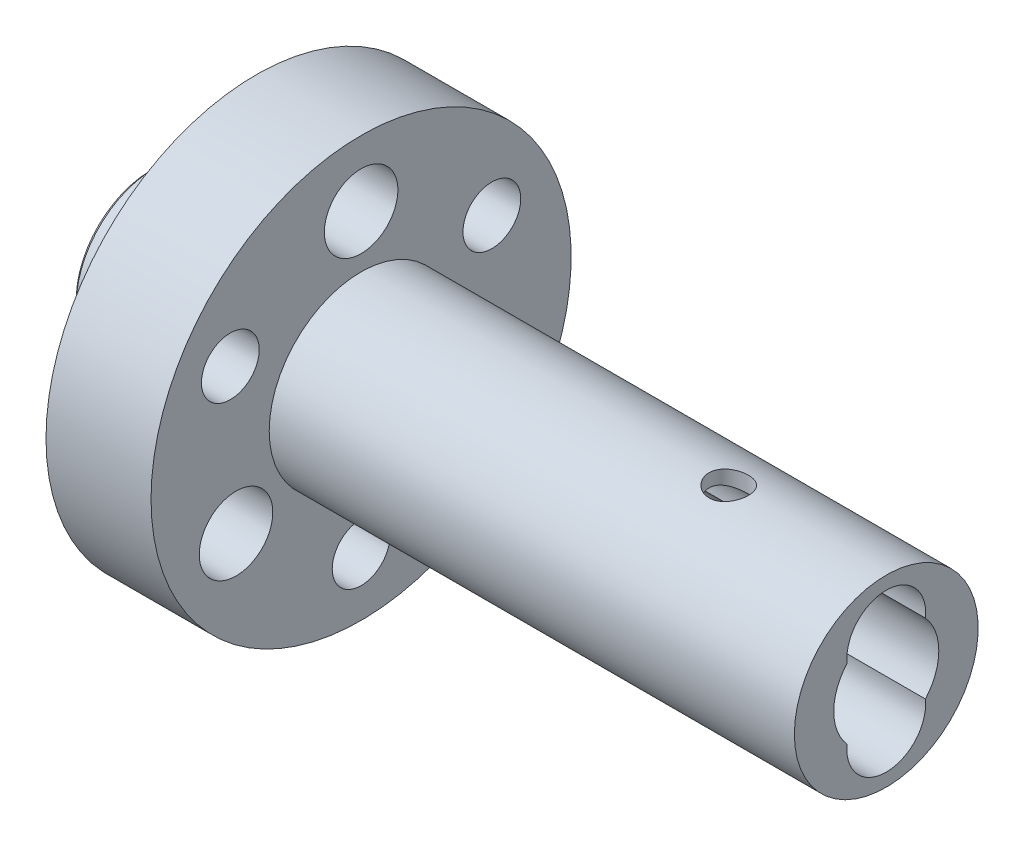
ISO-10303-21;
HEADER;
FILE_DESCRIPTION(('STEP AP214'),'2;1');
FILE_NAME('part.step','',(''),(''),'','','');
FILE_SCHEMA(('AUTOMOTIVE_DESIGN { 1 0 10303 214 1 1 1 1 }'));
ENDSEC;
DATA;
#1=APPLICATION_CONTEXT('core data for automotive mechanical design processes');
#2=APPLICATION_PROTOCOL_DEFINITION('international standard','automotive_design',2000,#1);
#3=PRODUCT_CONTEXT('',#1,'mechanical');
#4=PRODUCT('Part','Part','',(#3));
#5=PRODUCT_RELATED_PRODUCT_CATEGORY('part','',(#4));
#6=PRODUCT_DEFINITION_FORMATION('','',#4);
#7=PRODUCT_DEFINITION_CONTEXT('part definition',#1,'design');
#8=PRODUCT_DEFINITION('design','',#6,#7);
#9=PRODUCT_DEFINITION_SHAPE('','',#8);
#10=(LENGTH_UNIT() NAMED_UNIT(*) SI_UNIT(.MILLI.,.METRE.));
#11=(NAMED_UNIT(*) PLANE_ANGLE_UNIT() SI_UNIT($,.RADIAN.));
#12=(NAMED_UNIT(*) SI_UNIT($,.STERADIAN.) SOLID_ANGLE_UNIT());
#13=UNCERTAINTY_MEASURE_WITH_UNIT(LENGTH_MEASURE(1.E-05),#10,'distance_accuracy_value','');
#14=(GEOMETRIC_REPRESENTATION_CONTEXT(3) GLOBAL_UNCERTAINTY_ASSIGNED_CONTEXT((#13)) GLOBAL_UNIT_ASSIGNED_CONTEXT((#10,
#11,#12)) REPRESENTATION_CONTEXT('',''));
#15=CARTESIAN_POINT('',(0.,0.,0.));
#16=DIRECTION('',(0.,0.,1.));
#17=DIRECTION('',(1.,0.,0.));
#18=AXIS2_PLACEMENT_3D('',#15,#16,#17);
#19=CARTESIAN_POINT('',(3.19999999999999,2.85,0.));
#20=DIRECTION('',(-1.,0.,0.));
#21=DIRECTION('',(0.,0.,1.));
#22=AXIS2_PLACEMENT_3D('',#19,#20,#21);
#23=PLANE('',#22);
#24=CARTESIAN_POINT('',(3.19999999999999,0.,0.));
#25=DIRECTION('',(-1.,0.,0.));
#26=DIRECTION('',(0.,0.,1.));
#27=AXIS2_PLACEMENT_3D('',#24,#25,#26);
#28=CIRCLE('',#27,2.85);
#29=CARTESIAN_POINT('',(3.19999999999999,0.,2.85));
#30=VERTEX_POINT('',#29);
#31=EDGE_CURVE('E138',#30,#30,#28,.T.);
#32=ORIENTED_EDGE('',*,*,#31,.T.);
#33=EDGE_LOOP('',(#32));
#34=FACE_BOUND('',#33,.T.);
#35=CARTESIAN_POINT('',(3.19999999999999,0.,0.));
#36=DIRECTION('',(-1.,0.,0.));
#37=DIRECTION('',(0.,0.,1.));
#38=AXIS2_PLACEMENT_3D('',#35,#36,#37);
#39=CIRCLE('',#38,3.);
#40=CARTESIAN_POINT('',(3.19999999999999,0.,3.));
#41=VERTEX_POINT('',#40);
#42=EDGE_CURVE('E493',#41,#41,#39,.T.);
#43=ORIENTED_EDGE('',*,*,#42,.F.);
#44=EDGE_LOOP('',(#43));
#45=FACE_BOUND('',#44,.T.);
#46=ADVANCED_FACE('F33',(#34,#45),#23,.F.);
#47=CARTESIAN_POINT('',(0.,0.,0.));
#48=DIRECTION('',(1.,0.,0.));
#49=DIRECTION('',(0.,0.,-1.));
#50=AXIS2_PLACEMENT_3D('',#47,#48,#49);
#51=CONICAL_SURFACE('',#50,2.84999999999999,0.785398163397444);
#52=CARTESIAN_POINT('',(0.,0.,0.));
#53=DIRECTION('',(1.,0.,0.));
#54=DIRECTION('',(0.,0.,-1.));
#55=AXIS2_PLACEMENT_3D('',#52,#53,#54);
#56=CIRCLE('',#55,2.84999999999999);
#57=CARTESIAN_POINT('',(0.,0.,-2.84999999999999));
#58=VERTEX_POINT('',#57);
#59=EDGE_CURVE('E12',#58,#58,#56,.F.);
#60=ORIENTED_EDGE('',*,*,#59,.F.);
#61=EDGE_LOOP('',(#60));
#62=FACE_BOUND('',#61,.T.);
#63=CARTESIAN_POINT('',(0.150000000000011,0.,0.));
#64=DIRECTION('',(1.,0.,0.));
#65=DIRECTION('',(0.,0.,-1.));
#66=AXIS2_PLACEMENT_3D('',#63,#64,#65);
#67=CIRCLE('',#66,3.);
#68=CARTESIAN_POINT('',(0.150000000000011,0.,-3.));
#69=VERTEX_POINT('',#68);
#70=EDGE_CURVE('E37',#69,#69,#67,.F.);
#71=ORIENTED_EDGE('',*,*,#70,.T.);
#72=EDGE_LOOP('',(#71));
#73=FACE_BOUND('',#72,.T.);
#74=ADVANCED_FACE('F35',(#62,#73),#51,.T.);
#75=CARTESIAN_POINT('',(0.,3.15,0.));
#76=DIRECTION('',(1.,0.,0.));
#77=DIRECTION('',(0.,0.,-1.));
#78=AXIS2_PLACEMENT_3D('',#75,#76,#77);
#79=PLANE('',#78);
#80=CARTESIAN_POINT('',(0.,0.,0.));
#81=DIRECTION('',(-1.,0.,0.));
#82=DIRECTION('',(0.,0.,1.));
#83=AXIS2_PLACEMENT_3D('',#80,#81,#82);
#84=CIRCLE('',#83,2.5);
#85=CARTESIAN_POINT('',(0.,0.,2.5));
#86=VERTEX_POINT('',#85);
#87=EDGE_CURVE('E277',#86,#86,#84,.T.);
#88=ORIENTED_EDGE('',*,*,#87,.F.);
#89=EDGE_LOOP('',(#88));
#90=FACE_BOUND('',#89,.T.);
#91=ORIENTED_EDGE('',*,*,#59,.T.);
#92=EDGE_LOOP('',(#91));
#93=FACE_BOUND('',#92,.T.);
#94=ADVANCED_FACE('F223',(#90,#93),#79,.F.);
#95=CARTESIAN_POINT('',(1.,2.35,0.));
#96=DIRECTION('',(1.,0.,0.));
#97=DIRECTION('',(0.,0.,-1.));
#98=AXIS2_PLACEMENT_3D('',#95,#96,#97);
#99=PLANE('',#98);
#100=CARTESIAN_POINT('',(1.,0.,0.));
#101=DIRECTION('',(-1.,0.,0.));
#102=DIRECTION('',(0.,0.,1.));
#103=AXIS2_PLACEMENT_3D('',#100,#101,#102);
#104=CIRCLE('',#103,2.);
#105=CARTESIAN_POINT('',(1.,0.,2.));
#106=VERTEX_POINT('',#105);
#107=EDGE_CURVE('E158',#106,#106,#104,.T.);
#108=ORIENTED_EDGE('',*,*,#107,.F.);
#109=EDGE_LOOP('',(#108));
#110=FACE_BOUND('',#109,.T.);
#111=CARTESIAN_POINT('',(1.,0.,0.));
#112=DIRECTION('',(-1.,0.,0.));
#113=DIRECTION('',(0.,0.,1.));
#114=AXIS2_PLACEMENT_3D('',#111,#112,#113);
#115=CIRCLE('',#114,2.5);
#116=CARTESIAN_POINT('',(1.,0.,2.5));
#117=VERTEX_POINT('',#116);
#118=EDGE_CURVE('E273',#117,#117,#115,.T.);
#119=ORIENTED_EDGE('',*,*,#118,.T.);
#120=EDGE_LOOP('',(#119));
#121=FACE_BOUND('',#120,.T.);
#122=ADVANCED_FACE('F321',(#110,#121),#99,.F.);
#123=CARTESIAN_POINT('',(0.,0.,0.));
#124=DIRECTION('',(-1.,0.,0.));
#125=DIRECTION('',(0.,0.,1.));
#126=AXIS2_PLACEMENT_3D('',#123,#124,#125);
#127=CYLINDRICAL_SURFACE('',#126,2.);
#128=DIRECTION('',(1.,0.,0.));
#129=VECTOR('',#128,1.);
#130=CARTESIAN_POINT('',(18.,-1.33333333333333,1.49071198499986));
#131=LINE('',#130,#129);
#132=CARTESIAN_POINT('',(18.,-1.33333333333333,1.49071198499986));
#133=VERTEX_POINT('',#132);
#134=CARTESIAN_POINT('',(28.,-1.33333333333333,1.49071198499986));
#135=VERTEX_POINT('',#134);
#136=EDGE_CURVE('E49',#133,#135,#131,.T.);
#137=ORIENTED_EDGE('',*,*,#136,.F.);
#138=CARTESIAN_POINT('',(18.,0.,0.));
#139=DIRECTION('',(1.,0.,0.));
#140=DIRECTION('',(0.,0.,-1.));
#141=AXIS2_PLACEMENT_3D('',#138,#139,#140);
#142=CIRCLE('',#141,2.);
#143=CARTESIAN_POINT('',(18.,-1.33333333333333,-1.49071198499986));
#144=VERTEX_POINT('',#143);
#145=EDGE_CURVE('E42',#144,#133,#142,.F.);
#146=ORIENTED_EDGE('',*,*,#145,.F.);
#147=DIRECTION('',(1.,0.,0.));
#148=VECTOR('',#147,1.);
#149=CARTESIAN_POINT('',(18.,-1.33333333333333,-1.49071198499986));
#150=LINE('',#149,#148);
#151=CARTESIAN_POINT('',(28.,-1.33333333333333,-1.49071198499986));
#152=VERTEX_POINT('',#151);
#153=EDGE_CURVE('E85',#144,#152,#150,.T.);
#154=ORIENTED_EDGE('',*,*,#153,.T.);
#155=CARTESIAN_POINT('',(28.,0.,0.));
#156=DIRECTION('',(-1.,0.,0.));
#157=DIRECTION('',(0.,0.,1.));
#158=AXIS2_PLACEMENT_3D('',#155,#156,#157);
#159=CIRCLE('',#158,2.);
#160=CARTESIAN_POINT('',(28.,1.33333333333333,-1.49071198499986));
#161=VERTEX_POINT('',#160);
#162=EDGE_CURVE('E157',#161,#152,#159,.T.);
#163=ORIENTED_EDGE('',*,*,#162,.F.);
#164=DIRECTION('',(1.,0.,0.));
#165=VECTOR('',#164,1.);
#166=CARTESIAN_POINT('',(18.,1.33333333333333,-1.49071198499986));
#167=LINE('',#166,#165);
#168=CARTESIAN_POINT('',(18.,1.33333333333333,-1.49071198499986));
#169=VERTEX_POINT('',#168);
#170=EDGE_CURVE('E57',#169,#161,#167,.T.);
#171=ORIENTED_EDGE('',*,*,#170,.F.);
#172=CARTESIAN_POINT('',(18.,1.33333333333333,1.49071198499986));
#173=VERTEX_POINT('',#172);
#174=EDGE_CURVE('E81',#173,#169,#142,.F.);
#175=ORIENTED_EDGE('',*,*,#174,.F.);
#176=DIRECTION('',(1.,0.,0.));
#177=VECTOR('',#176,1.);
#178=CARTESIAN_POINT('',(18.,1.33333333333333,1.49071198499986));
#179=LINE('',#178,#177);
#180=CARTESIAN_POINT('',(28.,1.33333333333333,1.49071198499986));
#181=VERTEX_POINT('',#180);
#182=EDGE_CURVE('E195',#173,#181,#179,.T.);
#183=ORIENTED_EDGE('',*,*,#182,.T.);
#184=EDGE_CURVE('E94',#135,#181,#159,.T.);
#185=ORIENTED_EDGE('',*,*,#184,.F.);
#186=EDGE_LOOP('',(#137,#146,#154,#163,#171,#175,#183,#185));
#187=FACE_BOUND('',#186,.T.);
#188=ORIENTED_EDGE('',*,*,#107,.T.);
#189=EDGE_LOOP('',(#188));
#190=FACE_BOUND('',#189,.T.);
#191=ADVANCED_FACE('F90',(#187,#190),#127,.F.);
#192=CARTESIAN_POINT('',(28.,2.,0.));
#193=DIRECTION('',(-1.,0.,0.));
#194=DIRECTION('',(0.,0.,1.));
#195=AXIS2_PLACEMENT_3D('',#192,#193,#194);
#196=PLANE('',#195);
#197=CARTESIAN_POINT('',(28.,0.,0.));
#198=DIRECTION('',(-1.,0.,0.));
#199=DIRECTION('',(0.,0.,1.));
#200=AXIS2_PLACEMENT_3D('',#197,#198,#199);
#201=CIRCLE('',#200,3.5);
#202=CARTESIAN_POINT('',(28.,0.,3.5));
#203=VERTEX_POINT('',#202);
#204=EDGE_CURVE('E153',#203,#203,#201,.T.);
#205=ORIENTED_EDGE('',*,*,#204,.F.);
#206=EDGE_LOOP('',(#205));
#207=FACE_BOUND('',#206,.T.);
#208=ORIENTED_EDGE('',*,*,#184,.T.);
#209=CARTESIAN_POINT('',(28.,1.5,0.));
#210=DIRECTION('',(1.,0.,0.));
#211=DIRECTION('',(0.,0.,-1.));
#212=AXIS2_PLACEMENT_3D('',#209,#210,#211);
#213=CIRCLE('',#212,1.5);
#214=EDGE_CURVE('E87',#161,#181,#213,.T.);
#215=ORIENTED_EDGE('',*,*,#214,.F.);
#216=ORIENTED_EDGE('',*,*,#162,.T.);
#217=CARTESIAN_POINT('',(28.,-1.5,0.));
#218=DIRECTION('',(1.,0.,0.));
#219=DIRECTION('',(0.,0.,1.));
#220=AXIS2_PLACEMENT_3D('',#217,#218,#219);
#221=CIRCLE('',#220,1.5);
#222=EDGE_CURVE('E272',#135,#152,#221,.T.);
#223=ORIENTED_EDGE('',*,*,#222,.F.);
#224=EDGE_LOOP('',(#208,#215,#216,#223));
#225=FACE_BOUND('',#224,.T.);
#226=ADVANCED_FACE('F247',(#207,#225),#196,.F.);
#227=CARTESIAN_POINT('',(0.,0.,0.));
#228=DIRECTION('',(-1.,0.,0.));
#229=DIRECTION('',(0.,0.,1.));
#230=AXIS2_PLACEMENT_3D('',#227,#228,#229);
#231=CYLINDRICAL_SURFACE('',#230,3.5);
#232=CARTESIAN_POINT('',(22.,-3.41869858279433,0.750000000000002));
#233=CARTESIAN_POINT('',(22.0416055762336,-3.41869942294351,0.749998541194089));
#234=CARTESIAN_POINT('',(22.0832288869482,-3.41946636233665,0.746526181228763));
#235=CARTESIAN_POINT('',(22.1652933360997,-3.42244589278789,0.732742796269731));
#236=CARTESIAN_POINT('',(22.2057335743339,-3.42465955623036,0.72242669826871));
#237=CARTESIAN_POINT('',(22.2842328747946,-3.4302705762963,0.695294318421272));
#238=CARTESIAN_POINT('',(22.3222944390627,-3.43366666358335,0.678485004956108));
#239=CARTESIAN_POINT('',(22.3950576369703,-3.44125835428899,0.638863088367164));
#240=CARTESIAN_POINT('',(22.429759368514,-3.44545393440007,0.616050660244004));
#241=CARTESIAN_POINT('',(22.4953814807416,-3.45424789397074,0.564675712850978));
#242=CARTESIAN_POINT('',(22.5262394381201,-3.45885124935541,0.536034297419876));
#243=CARTESIAN_POINT('',(22.5827517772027,-3.46789845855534,0.473984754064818));
#244=CARTESIAN_POINT('',(22.60840576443,-3.47234230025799,0.440576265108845));
#245=CARTESIAN_POINT('',(22.6540277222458,-3.48062384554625,0.369523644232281));
#246=CARTESIAN_POINT('',(22.6739358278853,-3.4844549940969,0.331840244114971));
#247=CARTESIAN_POINT('',(22.7071138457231,-3.49102335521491,0.253567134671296));
#248=CARTESIAN_POINT('',(22.7203844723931,-3.49376068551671,0.212977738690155));
#249=CARTESIAN_POINT('',(22.7397149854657,-3.49779782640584,0.130693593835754));
#250=CARTESIAN_POINT('',(22.7458804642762,-3.49911866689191,0.0890247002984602));
#251=CARTESIAN_POINT('',(22.7511556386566,-3.50024681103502,0.00522447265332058));
#252=CARTESIAN_POINT('',(22.7502661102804,-3.5000542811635,-0.0369068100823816));
#253=CARTESIAN_POINT('',(22.7415355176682,-3.49819350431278,-0.119708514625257));
#254=CARTESIAN_POINT('',(22.733808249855,-3.49654941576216,-0.160391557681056));
#255=CARTESIAN_POINT('',(22.7118026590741,-3.49199770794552,-0.239869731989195));
#256=CARTESIAN_POINT('',(22.6975240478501,-3.48909003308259,-0.27866478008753));
#257=CARTESIAN_POINT('',(22.6627192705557,-3.48229877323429,-0.353583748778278));
#258=CARTESIAN_POINT('',(22.6421496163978,-3.47840842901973,-0.389686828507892));
#259=CARTESIAN_POINT('',(22.5953790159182,-3.47007896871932,-0.457970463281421));
#260=CARTESIAN_POINT('',(22.5691773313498,-3.46563978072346,-0.490150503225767));
#261=CARTESIAN_POINT('',(22.5112657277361,-3.45659663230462,-0.550351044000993));
#262=CARTESIAN_POINT('',(22.4794562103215,-3.45199115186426,-0.578275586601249));
#263=CARTESIAN_POINT('',(22.4115583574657,-3.44321783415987,-0.628411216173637));
#264=CARTESIAN_POINT('',(22.3754699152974,-3.43905000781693,-0.650622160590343));
#265=CARTESIAN_POINT('',(22.2998877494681,-3.43162011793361,-0.688740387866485));
#266=CARTESIAN_POINT('',(22.2603849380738,-3.42836057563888,-0.704630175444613));
#267=CARTESIAN_POINT('',(22.1791836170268,-3.42315170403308,-0.729517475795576));
#268=CARTESIAN_POINT('',(22.1374854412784,-3.42120217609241,-0.73851603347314));
#269=CARTESIAN_POINT('',(22.0539521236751,-3.41887440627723,-0.749217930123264));
#270=CARTESIAN_POINT('',(22.0121356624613,-3.4184661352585,-0.751060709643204));
#271=CARTESIAN_POINT('',(21.9287930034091,-3.41918619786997,-0.747775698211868));
#272=CARTESIAN_POINT('',(21.8872667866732,-3.42031443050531,-0.742648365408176));
#273=CARTESIAN_POINT('',(21.8061647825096,-3.42395207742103,-0.725689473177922));
#274=CARTESIAN_POINT('',(21.7665722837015,-3.42644577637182,-0.713934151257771));
#275=CARTESIAN_POINT('',(21.6899188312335,-3.43251929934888,-0.684135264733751));
#276=CARTESIAN_POINT('',(21.6528581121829,-3.43609922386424,-0.666091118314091));
#277=CARTESIAN_POINT('',(21.5817151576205,-3.44400817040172,-0.623917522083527));
#278=CARTESIAN_POINT('',(21.5476852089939,-3.44834750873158,-0.599701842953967));
#279=CARTESIAN_POINT('',(21.4841208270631,-3.45725887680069,-0.545985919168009));
#280=CARTESIAN_POINT('',(21.4545869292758,-3.46183093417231,-0.516485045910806));
#281=CARTESIAN_POINT('',(21.4003148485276,-3.47079119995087,-0.452406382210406));
#282=CARTESIAN_POINT('',(21.3756715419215,-3.47517467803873,-0.417747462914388));
#283=CARTESIAN_POINT('',(21.3325572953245,-3.4831780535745,-0.344700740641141));
#284=CARTESIAN_POINT('',(21.3140860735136,-3.48679798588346,-0.306313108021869));
#285=CARTESIAN_POINT('',(21.2839739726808,-3.49284639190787,-0.227132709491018));
#286=CARTESIAN_POINT('',(21.2722908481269,-3.49528221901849,-0.186356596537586));
#287=CARTESIAN_POINT('',(21.2559541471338,-3.4987196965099,-0.103362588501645));
#288=CARTESIAN_POINT('',(21.251299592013,-3.49972154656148,-0.0611448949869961));
#289=CARTESIAN_POINT('',(21.2491946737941,-3.50017255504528,0.0226318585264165));
#290=CARTESIAN_POINT('',(21.2516024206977,-3.49965229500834,0.0641872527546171));
#291=CARTESIAN_POINT('',(21.2632373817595,-3.49718276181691,0.146286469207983));
#292=CARTESIAN_POINT('',(21.2724644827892,-3.49523351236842,0.186830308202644));
#293=CARTESIAN_POINT('',(21.2974094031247,-3.49012694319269,0.265650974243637));
#294=CARTESIAN_POINT('',(21.3131078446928,-3.48697323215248,0.303934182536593));
#295=CARTESIAN_POINT('',(21.3505306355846,-3.47979518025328,0.377342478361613));
#296=CARTESIAN_POINT('',(21.372255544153,-3.47577075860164,0.412467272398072));
#297=CARTESIAN_POINT('',(21.4215811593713,-3.46719904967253,0.479256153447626));
#298=CARTESIAN_POINT('',(21.4492820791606,-3.4626435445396,0.510845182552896));
#299=CARTESIAN_POINT('',(21.5095703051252,-3.45356845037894,0.568975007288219));
#300=CARTESIAN_POINT('',(21.5421587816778,-3.44904887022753,0.595514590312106));
#301=CARTESIAN_POINT('',(21.6117952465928,-3.44049346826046,0.643116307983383));
#302=CARTESIAN_POINT('',(21.6488946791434,-3.43646452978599,0.664104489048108));
#303=CARTESIAN_POINT('',(21.7261718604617,-3.42943248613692,0.699515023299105));
#304=CARTESIAN_POINT('',(21.7663469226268,-3.42642849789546,0.71394303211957));
#305=CARTESIAN_POINT('',(21.8388130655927,-3.42235280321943,0.733193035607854));
#306=CARTESIAN_POINT('',(21.8707058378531,-3.42099141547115,0.739483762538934));
#307=CARTESIAN_POINT('',(21.9350621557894,-3.41916399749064,0.747887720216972));
#308=CARTESIAN_POINT('',(21.967525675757,-3.41869792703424,0.75000113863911));
#309=CARTESIAN_POINT('',(22.,-3.41869858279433,0.750000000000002));
#310=B_SPLINE_CURVE_WITH_KNOTS('',3,(#232,#233,#234,#235,#236,#237,#238,#239,#240,#241,#242,
#243,#244,#245,#246,#247,#248,#249,#250,#251,#252,#253,#254,#255,#256,#257,#258,#259,#260,#261,
#262,#263,#264,#265,#266,#267,#268,#269,#270,#271,#272,#273,#274,#275,#276,#277,#278,#279,#280,
#281,#282,#283,#284,#285,#286,#287,#288,#289,#290,#291,#292,#293,#294,#295,#296,#297,#298,#299,
#300,#301,#302,#303,#304,#305,#306,#307,#308,#309),.UNSPECIFIED.,.T.,.F.,(4,2,2,2,2,2,2,2,2,2,2,
2,2,2,2,2,2,2,2,2,2,2,2,2,2,2,2,2,2,2,2,2,2,2,2,2,2,2,4),(0.,0.124697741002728,
0.249488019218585,0.374144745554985,0.498797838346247,0.625266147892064,0.751744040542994,
0.879495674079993,1.00723355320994,1.13304754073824,1.25884768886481,1.38259278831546,
1.50634333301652,1.63096944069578,1.75561189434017,1.88274480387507,2.00988088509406,
2.1373664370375,2.26483265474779,2.38980216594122,2.51476346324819,2.63831590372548,
2.76187977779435,2.88727505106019,3.01268524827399,3.14033107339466,3.26797106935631,
3.39480794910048,3.5216271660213,3.64591599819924,3.77020276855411,3.89412004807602,
4.01804883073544,4.14424457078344,4.27047057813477,4.39830190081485,4.52602280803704,
4.62335728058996,4.72068738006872),.UNSPECIFIED.);
#311=CARTESIAN_POINT('',(22.,-3.41869858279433,0.750000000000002));
#312=VERTEX_POINT('',#311);
#313=EDGE_CURVE('E105',#312,#312,#310,.T.);
#314=ORIENTED_EDGE('',*,*,#313,.T.);
#315=EDGE_LOOP('',(#314));
#316=FACE_BOUND('',#315,.T.);
#317=CARTESIAN_POINT('',(22.,3.41869858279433,0.750000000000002));
#318=CARTESIAN_POINT('',(21.9583944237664,3.41869942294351,0.74999854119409));
#319=CARTESIAN_POINT('',(21.9167711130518,3.41946636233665,0.746526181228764));
#320=CARTESIAN_POINT('',(21.8347066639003,3.42244589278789,0.732742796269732));
#321=CARTESIAN_POINT('',(21.7942664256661,3.42465955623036,0.722426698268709));
#322=CARTESIAN_POINT('',(21.7157671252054,3.4302705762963,0.695294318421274));
#323=CARTESIAN_POINT('',(21.6777055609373,3.43366666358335,0.678485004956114));
#324=CARTESIAN_POINT('',(21.6049423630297,3.44125835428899,0.638863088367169));
#325=CARTESIAN_POINT('',(21.570240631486,3.44545393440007,0.616050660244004));
#326=CARTESIAN_POINT('',(21.5046185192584,3.45424789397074,0.564675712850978));
#327=CARTESIAN_POINT('',(21.4737605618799,3.45885124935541,0.536034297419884));
#328=CARTESIAN_POINT('',(21.4172482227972,3.46789845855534,0.473984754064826));
#329=CARTESIAN_POINT('',(21.39159423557,3.47234230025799,0.440576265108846));
#330=CARTESIAN_POINT('',(21.3459722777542,3.48062384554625,0.36952364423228));
#331=CARTESIAN_POINT('',(21.3260641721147,3.4844549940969,0.331840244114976));
#332=CARTESIAN_POINT('',(21.2928861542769,3.49102335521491,0.253567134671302));
#333=CARTESIAN_POINT('',(21.2796155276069,3.49376068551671,0.212977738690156));
#334=CARTESIAN_POINT('',(21.2602850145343,3.49779782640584,0.130693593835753));
#335=CARTESIAN_POINT('',(21.2541195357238,3.49911866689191,0.0890247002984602));
#336=CARTESIAN_POINT('',(21.2488443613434,3.50024681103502,0.0052244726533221));
#337=CARTESIAN_POINT('',(21.2497338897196,3.5000542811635,-0.0369068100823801));
#338=CARTESIAN_POINT('',(21.2584644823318,3.49819350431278,-0.119708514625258));
#339=CARTESIAN_POINT('',(21.266191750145,3.49654941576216,-0.160391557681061));
#340=CARTESIAN_POINT('',(21.2881973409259,3.49199770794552,-0.239869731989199));
#341=CARTESIAN_POINT('',(21.3024759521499,3.48909003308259,-0.278664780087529));
#342=CARTESIAN_POINT('',(21.3372807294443,3.48229877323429,-0.353583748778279));
#343=CARTESIAN_POINT('',(21.3578503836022,3.47840842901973,-0.389686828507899));
#344=CARTESIAN_POINT('',(21.4046209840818,3.47007896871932,-0.457970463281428));
#345=CARTESIAN_POINT('',(21.4308226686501,3.46563978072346,-0.490150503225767));
#346=CARTESIAN_POINT('',(21.4887342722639,3.45659663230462,-0.550351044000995));
#347=CARTESIAN_POINT('',(21.5205437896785,3.45199115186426,-0.578275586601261));
#348=CARTESIAN_POINT('',(21.5884416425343,3.44321783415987,-0.628411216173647));
#349=CARTESIAN_POINT('',(21.6245300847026,3.43905000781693,-0.650622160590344));
#350=CARTESIAN_POINT('',(21.7001122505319,3.43162011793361,-0.688740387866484));
#351=CARTESIAN_POINT('',(21.7396150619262,3.42836057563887,-0.70463017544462));
#352=CARTESIAN_POINT('',(21.8208163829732,3.42315170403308,-0.729517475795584));
#353=CARTESIAN_POINT('',(21.8625145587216,3.42120217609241,-0.738516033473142));
#354=CARTESIAN_POINT('',(21.9460478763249,3.41887440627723,-0.749217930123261));
#355=CARTESIAN_POINT('',(21.9878643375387,3.4184661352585,-0.751060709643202));
#356=CARTESIAN_POINT('',(22.0712069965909,3.41918619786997,-0.747775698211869));
#357=CARTESIAN_POINT('',(22.1127332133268,3.42031443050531,-0.742648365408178));
#358=CARTESIAN_POINT('',(22.1938352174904,3.42395207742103,-0.725689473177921));
#359=CARTESIAN_POINT('',(22.2334277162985,3.42644577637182,-0.713934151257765));
#360=CARTESIAN_POINT('',(22.3100811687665,3.43251929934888,-0.684135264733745));
#361=CARTESIAN_POINT('',(22.3471418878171,3.43609922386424,-0.666091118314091));
#362=CARTESIAN_POINT('',(22.4182848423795,3.44400817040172,-0.623917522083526));
#363=CARTESIAN_POINT('',(22.4523147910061,3.44834750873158,-0.59970184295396));
#364=CARTESIAN_POINT('',(22.5158791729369,3.45725887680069,-0.545985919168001));
#365=CARTESIAN_POINT('',(22.5454130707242,3.46183093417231,-0.516485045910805));
#366=CARTESIAN_POINT('',(22.5996851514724,3.47079119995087,-0.452406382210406));
#367=CARTESIAN_POINT('',(22.6243284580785,3.47517467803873,-0.417747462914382));
#368=CARTESIAN_POINT('',(22.6674427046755,3.4831780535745,-0.344700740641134));
#369=CARTESIAN_POINT('',(22.6859139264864,3.48679798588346,-0.306313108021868));
#370=CARTESIAN_POINT('',(22.7160260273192,3.49284639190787,-0.227132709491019));
#371=CARTESIAN_POINT('',(22.7277091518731,3.49528221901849,-0.186356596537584));
#372=CARTESIAN_POINT('',(22.7440458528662,3.4987196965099,-0.103362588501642));
#373=CARTESIAN_POINT('',(22.748700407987,3.49972154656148,-0.0611448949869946));
#374=CARTESIAN_POINT('',(22.7508053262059,3.50017255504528,0.0226318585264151));
#375=CARTESIAN_POINT('',(22.7483975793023,3.49965229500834,0.0641872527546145));
#376=CARTESIAN_POINT('',(22.7367626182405,3.49718276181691,0.146286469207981));
#377=CARTESIAN_POINT('',(22.7275355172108,3.49523351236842,0.186830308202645));
#378=CARTESIAN_POINT('',(22.7025905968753,3.49012694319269,0.265650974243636));
#379=CARTESIAN_POINT('',(22.6868921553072,3.48697323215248,0.303934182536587));
#380=CARTESIAN_POINT('',(22.6494693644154,3.47979518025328,0.377342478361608));
#381=CARTESIAN_POINT('',(22.627744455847,3.47577075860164,0.412467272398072));
#382=CARTESIAN_POINT('',(22.5784188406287,3.46719904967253,0.479256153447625));
#383=CARTESIAN_POINT('',(22.5507179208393,3.4626435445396,0.510845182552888));
#384=CARTESIAN_POINT('',(22.4904296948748,3.45356845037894,0.56897500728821));
#385=CARTESIAN_POINT('',(22.4578412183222,3.44904887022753,0.595514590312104));
#386=CARTESIAN_POINT('',(22.3882047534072,3.44049346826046,0.643116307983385));
#387=CARTESIAN_POINT('',(22.3511053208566,3.43646452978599,0.664104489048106));
#388=CARTESIAN_POINT('',(22.2738281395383,3.42943248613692,0.699515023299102));
#389=CARTESIAN_POINT('',(22.2336530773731,3.42642849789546,0.713943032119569));
#390=CARTESIAN_POINT('',(22.1611869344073,3.42235280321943,0.733193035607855));
#391=CARTESIAN_POINT('',(22.1292941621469,3.42099141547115,0.739483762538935));
#392=CARTESIAN_POINT('',(22.0649378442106,3.41916399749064,0.747887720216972));
#393=CARTESIAN_POINT('',(22.032474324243,3.41869792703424,0.75000113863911));
#394=CARTESIAN_POINT('',(22.,3.41869858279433,0.750000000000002));
#395=B_SPLINE_CURVE_WITH_KNOTS('',3,(#317,#318,#319,#320,#321,#322,#323,#324,#325,#326,#327,
#328,#329,#330,#331,#332,#333,#334,#335,#336,#337,#338,#339,#340,#341,#342,#343,#344,#345,#346,
#347,#348,#349,#350,#351,#352,#353,#354,#355,#356,#357,#358,#359,#360,#361,#362,#363,#364,#365,
#366,#367,#368,#369,#370,#371,#372,#373,#374,#375,#376,#377,#378,#379,#380,#381,#382,#383,#384,
#385,#386,#387,#388,#389,#390,#391,#392,#393,#394),.UNSPECIFIED.,.T.,.F.,(4,2,2,2,2,2,2,2,2,2,2,
2,2,2,2,2,2,2,2,2,2,2,2,2,2,2,2,2,2,2,2,2,2,2,2,2,2,2,4),(0.,0.124697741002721,
0.249488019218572,0.374144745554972,0.498797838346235,0.625266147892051,0.751744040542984,
0.879495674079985,1.00723355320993,1.13304754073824,1.2588476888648,1.38259278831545,
1.50634333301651,1.63096944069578,1.75561189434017,1.88274480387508,2.00988088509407,
2.13736643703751,2.2648326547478,2.38980216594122,2.51476346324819,2.63831590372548,
2.76187977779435,2.88727505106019,3.01268524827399,3.14033107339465,3.26797106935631,
3.39480794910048,3.52162716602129,3.64591599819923,3.7702027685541,3.89412004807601,
4.01804883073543,4.14424457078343,4.27047057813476,4.39830190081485,4.52602280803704,
4.62335728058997,4.72068738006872),.UNSPECIFIED.);
#396=CARTESIAN_POINT('',(22.,3.41869858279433,0.750000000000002));
#397=VERTEX_POINT('',#396);
#398=EDGE_CURVE('E161',#397,#397,#395,.T.);
#399=ORIENTED_EDGE('',*,*,#398,.T.);
#400=EDGE_LOOP('',(#399));
#401=FACE_BOUND('',#400,.T.);
#402=CARTESIAN_POINT('',(8.00000000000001,0.,0.));
#403=DIRECTION('',(-1.,0.,0.));
#404=DIRECTION('',(0.,0.,1.));
#405=AXIS2_PLACEMENT_3D('',#402,#403,#404);
#406=CIRCLE('',#405,3.5);
#407=CARTESIAN_POINT('',(8.00000000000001,0.,3.5));
#408=VERTEX_POINT('',#407);
#409=EDGE_CURVE('E150',#408,#408,#406,.T.);
#410=ORIENTED_EDGE('',*,*,#409,.F.);
#411=EDGE_LOOP('',(#410));
#412=FACE_BOUND('',#411,.T.);
#413=ORIENTED_EDGE('',*,*,#204,.T.);
#414=EDGE_LOOP('',(#413));
#415=FACE_BOUND('',#414,.T.);
#416=ADVANCED_FACE('F172',(#316,#401,#412,#415),#231,.T.);
#417=CARTESIAN_POINT('',(8.00000000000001,3.5,0.));
#418=DIRECTION('',(-1.,0.,0.));
#419=DIRECTION('',(0.,0.,1.));
#420=AXIS2_PLACEMENT_3D('',#417,#418,#419);
#421=PLANE('',#420);
#422=CARTESIAN_POINT('',(8.00000000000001,2.87499999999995,-4.97964607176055));
#423=DIRECTION('',(-1.,0.,0.));
#424=DIRECTION('',(0.,0.,1.));
#425=AXIS2_PLACEMENT_3D('',#422,#423,#424);
#426=CIRCLE('',#425,1.09999999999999);
#427=CARTESIAN_POINT('',(8.00000000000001,2.87499999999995,-3.87964607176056));
#428=VERTEX_POINT('',#427);
#429=EDGE_CURVE('E104',#428,#428,#426,.T.);
#430=ORIENTED_EDGE('',*,*,#429,.T.);
#431=EDGE_LOOP('',(#430));
#432=FACE_BOUND('',#431,.T.);
#433=CARTESIAN_POINT('',(8.00000000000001,2.87500000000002,4.97964607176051));
#434=DIRECTION('',(-1.,0.,0.));
#435=DIRECTION('',(0.,0.,1.));
#436=AXIS2_PLACEMENT_3D('',#433,#434,#435);
#437=CIRCLE('',#436,1.09999999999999);
#438=CARTESIAN_POINT('',(8.00000000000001,2.87500000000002,6.0796460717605));
#439=VERTEX_POINT('',#438);
#440=EDGE_CURVE('E111',#439,#439,#437,.T.);
#441=ORIENTED_EDGE('',*,*,#440,.T.);
#442=EDGE_LOOP('',(#441));
#443=FACE_BOUND('',#442,.T.);
#444=CARTESIAN_POINT('',(8.00000000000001,-2.74999999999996,4.76313972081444));
#445=DIRECTION('',(-1.,0.,0.));
#446=DIRECTION('',(0.,0.,1.));
#447=AXIS2_PLACEMENT_3D('',#444,#445,#446);
#448=CIRCLE('',#447,1.39999999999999);
#449=CARTESIAN_POINT('',(8.00000000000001,-2.74999999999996,6.16313972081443));
#450=VERTEX_POINT('',#449);
#451=EDGE_CURVE('E117',#450,#450,#448,.T.);
#452=ORIENTED_EDGE('',*,*,#451,.T.);
#453=EDGE_LOOP('',(#452));
#454=FACE_BOUND('',#453,.T.);
#455=CARTESIAN_POINT('',(8.00000000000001,-2.75000000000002,-4.7631397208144));
#456=DIRECTION('',(-1.,0.,0.));
#457=DIRECTION('',(0.,0.,1.));
#458=AXIS2_PLACEMENT_3D('',#455,#456,#457);
#459=CIRCLE('',#458,1.39999999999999);
#460=CARTESIAN_POINT('',(8.00000000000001,-2.75000000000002,-3.36313972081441));
#461=VERTEX_POINT('',#460);
#462=EDGE_CURVE('E123',#461,#461,#459,.T.);
#463=ORIENTED_EDGE('',*,*,#462,.T.);
#464=EDGE_LOOP('',(#463));
#465=FACE_BOUND('',#464,.T.);
#466=CARTESIAN_POINT('',(8.00000000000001,-5.75,0.));
#467=DIRECTION('',(-1.,0.,0.));
#468=DIRECTION('',(0.,0.,1.));
#469=AXIS2_PLACEMENT_3D('',#466,#467,#468);
#470=CIRCLE('',#469,1.09999999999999);
#471=CARTESIAN_POINT('',(8.00000000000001,-5.75,1.09999999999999));
#472=VERTEX_POINT('',#471);
#473=EDGE_CURVE('E129',#472,#472,#470,.T.);
#474=ORIENTED_EDGE('',*,*,#473,.T.);
#475=EDGE_LOOP('',(#474));
#476=FACE_BOUND('',#475,.T.);
#477=CARTESIAN_POINT('',(8.00000000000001,5.5,0.));
#478=DIRECTION('',(-1.,0.,0.));
#479=DIRECTION('',(0.,0.,1.));
#480=AXIS2_PLACEMENT_3D('',#477,#478,#479);
#481=CIRCLE('',#480,1.39999999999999);
#482=CARTESIAN_POINT('',(8.00000000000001,5.5,1.39999999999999));
#483=VERTEX_POINT('',#482);
#484=EDGE_CURVE('E135',#483,#483,#481,.T.);
#485=ORIENTED_EDGE('',*,*,#484,.T.);
#486=EDGE_LOOP('',(#485));
#487=FACE_BOUND('',#486,.T.);
#488=CARTESIAN_POINT('',(8.00000000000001,0.,0.));
#489=DIRECTION('',(-1.,0.,0.));
#490=DIRECTION('',(0.,0.,1.));
#491=AXIS2_PLACEMENT_3D('',#488,#489,#490);
#492=CIRCLE('',#491,8.);
#493=CARTESIAN_POINT('',(8.00000000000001,0.,8.));
#494=VERTEX_POINT('',#493);
#495=EDGE_CURVE('E147',#494,#494,#492,.T.);
#496=ORIENTED_EDGE('',*,*,#495,.F.);
#497=EDGE_LOOP('',(#496));
#498=FACE_BOUND('',#497,.T.);
#499=ORIENTED_EDGE('',*,*,#409,.T.);
#500=EDGE_LOOP('',(#499));
#501=FACE_BOUND('',#500,.T.);
#502=ADVANCED_FACE('F240',(#432,#443,#454,#465,#476,#487,#498,#501),#421,.F.);
#503=CARTESIAN_POINT('',(0.,0.,0.));
#504=DIRECTION('',(-1.,0.,0.));
#505=DIRECTION('',(0.,0.,1.));
#506=AXIS2_PLACEMENT_3D('',#503,#504,#505);
#507=CYLINDRICAL_SURFACE('',#506,8.);
#508=CARTESIAN_POINT('',(4.,0.,0.));
#509=DIRECTION('',(-1.,0.,0.));
#510=DIRECTION('',(0.,0.,1.));
#511=AXIS2_PLACEMENT_3D('',#508,#509,#510);
#512=CIRCLE('',#511,8.);
#513=CARTESIAN_POINT('',(4.,0.,8.));
#514=VERTEX_POINT('',#513);
#515=EDGE_CURVE('E144',#514,#514,#512,.T.);
#516=ORIENTED_EDGE('',*,*,#515,.F.);
#517=EDGE_LOOP('',(#516));
#518=FACE_BOUND('',#517,.T.);
#519=ORIENTED_EDGE('',*,*,#495,.T.);
#520=EDGE_LOOP('',(#519));
#521=FACE_BOUND('',#520,.T.);
#522=ADVANCED_FACE('F237',(#518,#521),#507,.T.);
#523=CARTESIAN_POINT('',(4.,8.,0.));
#524=DIRECTION('',(1.,0.,0.));
#525=DIRECTION('',(0.,0.,-1.));
#526=AXIS2_PLACEMENT_3D('',#523,#524,#525);
#527=PLANE('',#526);
#528=CARTESIAN_POINT('',(4.,2.87499999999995,-4.97964607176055));
#529=DIRECTION('',(-1.,0.,0.));
#530=DIRECTION('',(0.,0.,1.));
#531=AXIS2_PLACEMENT_3D('',#528,#529,#530);
#532=CIRCLE('',#531,1.09999999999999);
#533=CARTESIAN_POINT('',(4.,2.87499999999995,-3.87964607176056));
#534=VERTEX_POINT('',#533);
#535=EDGE_CURVE('E101',#534,#534,#532,.T.);
#536=ORIENTED_EDGE('',*,*,#535,.F.);
#537=EDGE_LOOP('',(#536));
#538=FACE_BOUND('',#537,.T.);
#539=CARTESIAN_POINT('',(4.,2.87500000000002,4.97964607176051));
#540=DIRECTION('',(-1.,0.,0.));
#541=DIRECTION('',(0.,0.,1.));
#542=AXIS2_PLACEMENT_3D('',#539,#540,#541);
#543=CIRCLE('',#542,1.09999999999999);
#544=CARTESIAN_POINT('',(4.,2.87500000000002,6.0796460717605));
#545=VERTEX_POINT('',#544);
#546=EDGE_CURVE('E108',#545,#545,#543,.T.);
#547=ORIENTED_EDGE('',*,*,#546,.F.);
#548=EDGE_LOOP('',(#547));
#549=FACE_BOUND('',#548,.T.);
#550=CARTESIAN_POINT('',(4.,-2.74999999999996,4.76313972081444));
#551=DIRECTION('',(-1.,0.,0.));
#552=DIRECTION('',(0.,0.,1.));
#553=AXIS2_PLACEMENT_3D('',#550,#551,#552);
#554=CIRCLE('',#553,1.39999999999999);
#555=CARTESIAN_POINT('',(4.,-2.74999999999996,6.16313972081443));
#556=VERTEX_POINT('',#555);
#557=EDGE_CURVE('E114',#556,#556,#554,.T.);
#558=ORIENTED_EDGE('',*,*,#557,.F.);
#559=EDGE_LOOP('',(#558));
#560=FACE_BOUND('',#559,.T.);
#561=CARTESIAN_POINT('',(4.,-2.75000000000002,-4.7631397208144));
#562=DIRECTION('',(-1.,0.,0.));
#563=DIRECTION('',(0.,0.,1.));
#564=AXIS2_PLACEMENT_3D('',#561,#562,#563);
#565=CIRCLE('',#564,1.39999999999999);
#566=CARTESIAN_POINT('',(4.,-2.75000000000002,-3.36313972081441));
#567=VERTEX_POINT('',#566);
#568=EDGE_CURVE('E120',#567,#567,#565,.T.);
#569=ORIENTED_EDGE('',*,*,#568,.F.);
#570=EDGE_LOOP('',(#569));
#571=FACE_BOUND('',#570,.T.);
#572=CARTESIAN_POINT('',(4.,-5.75,0.));
#573=DIRECTION('',(-1.,0.,0.));
#574=DIRECTION('',(0.,0.,1.));
#575=AXIS2_PLACEMENT_3D('',#572,#573,#574);
#576=CIRCLE('',#575,1.09999999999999);
#577=CARTESIAN_POINT('',(4.,-5.75,1.09999999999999));
#578=VERTEX_POINT('',#577);
#579=EDGE_CURVE('E126',#578,#578,#576,.T.);
#580=ORIENTED_EDGE('',*,*,#579,.F.);
#581=EDGE_LOOP('',(#580));
#582=FACE_BOUND('',#581,.T.);
#583=CARTESIAN_POINT('',(4.,5.5,0.));
#584=DIRECTION('',(-1.,0.,0.));
#585=DIRECTION('',(0.,0.,1.));
#586=AXIS2_PLACEMENT_3D('',#583,#584,#585);
#587=CIRCLE('',#586,1.39999999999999);
#588=CARTESIAN_POINT('',(4.,5.5,1.39999999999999));
#589=VERTEX_POINT('',#588);
#590=EDGE_CURVE('E132',#589,#589,#587,.T.);
#591=ORIENTED_EDGE('',*,*,#590,.F.);
#592=EDGE_LOOP('',(#591));
#593=FACE_BOUND('',#592,.T.);
#594=ORIENTED_EDGE('',*,*,#515,.T.);
#595=EDGE_LOOP('',(#594));
#596=FACE_BOUND('',#595,.T.);
#597=CARTESIAN_POINT('',(4.,0.,0.));
#598=DIRECTION('',(-1.,0.,0.));
#599=DIRECTION('',(0.,0.,1.));
#600=AXIS2_PLACEMENT_3D('',#597,#598,#599);
#601=CIRCLE('',#600,2.85);
#602=CARTESIAN_POINT('',(4.,0.,2.85));
#603=VERTEX_POINT('',#602);
#604=EDGE_CURVE('E141',#603,#603,#601,.T.);
#605=ORIENTED_EDGE('',*,*,#604,.F.);
#606=EDGE_LOOP('',(#605));
#607=FACE_BOUND('',#606,.T.);
#608=ADVANCED_FACE('F233',(#538,#549,#560,#571,#582,#593,#596,#607),#527,.F.);
#609=CARTESIAN_POINT('',(0.,0.,0.));
#610=DIRECTION('',(-1.,0.,0.));
#611=DIRECTION('',(0.,0.,1.));
#612=AXIS2_PLACEMENT_3D('',#609,#610,#611);
#613=CYLINDRICAL_SURFACE('',#612,2.85);
#614=ORIENTED_EDGE('',*,*,#31,.F.);
#615=EDGE_LOOP('',(#614));
#616=FACE_BOUND('',#615,.T.);
#617=ORIENTED_EDGE('',*,*,#604,.T.);
#618=EDGE_LOOP('',(#617));
#619=FACE_BOUND('',#618,.T.);
#620=ADVANCED_FACE('F230',(#616,#619),#613,.T.);
#621=CARTESIAN_POINT('',(4.,5.5,0.));
#622=DIRECTION('',(-1.,0.,0.));
#623=DIRECTION('',(0.,0.,1.));
#624=AXIS2_PLACEMENT_3D('',#621,#622,#623);
#625=CYLINDRICAL_SURFACE('',#624,1.39999999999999);
#626=ORIENTED_EDGE('',*,*,#590,.T.);
#627=EDGE_LOOP('',(#626));
#628=FACE_BOUND('',#627,.T.);
#629=ORIENTED_EDGE('',*,*,#484,.F.);
#630=EDGE_LOOP('',(#629));
#631=FACE_BOUND('',#630,.T.);
#632=ADVANCED_FACE('F228',(#628,#631),#625,.F.);
#633=CARTESIAN_POINT('',(4.,-5.75,0.));
#634=DIRECTION('',(-1.,0.,0.));
#635=DIRECTION('',(0.,0.,1.));
#636=AXIS2_PLACEMENT_3D('',#633,#634,#635);
#637=CYLINDRICAL_SURFACE('',#636,1.09999999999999);
#638=ORIENTED_EDGE('',*,*,#579,.T.);
#639=EDGE_LOOP('',(#638));
#640=FACE_BOUND('',#639,.T.);
#641=ORIENTED_EDGE('',*,*,#473,.F.);
#642=EDGE_LOOP('',(#641));
#643=FACE_BOUND('',#642,.T.);
#644=ADVANCED_FACE('F381',(#640,#643),#637,.F.);
#645=CARTESIAN_POINT('',(4.,-2.75000000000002,-4.7631397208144));
#646=DIRECTION('',(-1.,0.,0.));
#647=DIRECTION('',(0.,0.,1.));
#648=AXIS2_PLACEMENT_3D('',#645,#646,#647);
#649=CYLINDRICAL_SURFACE('',#648,1.39999999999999);
#650=ORIENTED_EDGE('',*,*,#568,.T.);
#651=EDGE_LOOP('',(#650));
#652=FACE_BOUND('',#651,.T.);
#653=ORIENTED_EDGE('',*,*,#462,.F.);
#654=EDGE_LOOP('',(#653));
#655=FACE_BOUND('',#654,.T.);
#656=ADVANCED_FACE('F390',(#652,#655),#649,.F.);
#657=CARTESIAN_POINT('',(4.,-2.74999999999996,4.76313972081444));
#658=DIRECTION('',(-1.,0.,0.));
#659=DIRECTION('',(0.,0.,1.));
#660=AXIS2_PLACEMENT_3D('',#657,#658,#659);
#661=CYLINDRICAL_SURFACE('',#660,1.39999999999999);
#662=ORIENTED_EDGE('',*,*,#557,.T.);
#663=EDGE_LOOP('',(#662));
#664=FACE_BOUND('',#663,.T.);
#665=ORIENTED_EDGE('',*,*,#451,.F.);
#666=EDGE_LOOP('',(#665));
#667=FACE_BOUND('',#666,.T.);
#668=ADVANCED_FACE('F399',(#664,#667),#661,.F.);
#669=CARTESIAN_POINT('',(4.,2.87500000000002,4.97964607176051));
#670=DIRECTION('',(-1.,0.,0.));
#671=DIRECTION('',(0.,0.,1.));
#672=AXIS2_PLACEMENT_3D('',#669,#670,#671);
#673=CYLINDRICAL_SURFACE('',#672,1.09999999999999);
#674=ORIENTED_EDGE('',*,*,#546,.T.);
#675=EDGE_LOOP('',(#674));
#676=FACE_BOUND('',#675,.T.);
#677=ORIENTED_EDGE('',*,*,#440,.F.);
#678=EDGE_LOOP('',(#677));
#679=FACE_BOUND('',#678,.T.);
#680=ADVANCED_FACE('F409',(#676,#679),#673,.F.);
#681=CARTESIAN_POINT('',(4.,2.87499999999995,-4.97964607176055));
#682=DIRECTION('',(-1.,0.,0.));
#683=DIRECTION('',(0.,0.,1.));
#684=AXIS2_PLACEMENT_3D('',#681,#682,#683);
#685=CYLINDRICAL_SURFACE('',#684,1.09999999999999);
#686=ORIENTED_EDGE('',*,*,#535,.T.);
#687=EDGE_LOOP('',(#686));
#688=FACE_BOUND('',#687,.T.);
#689=ORIENTED_EDGE('',*,*,#429,.F.);
#690=EDGE_LOOP('',(#689));
#691=FACE_BOUND('',#690,.T.);
#692=ADVANCED_FACE('F185',(#688,#691),#685,.F.);
#693=CARTESIAN_POINT('',(22.,-9.50000000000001,0.));
#694=DIRECTION('',(0.,1.,0.));
#695=DIRECTION('',(0.,0.,1.));
#696=AXIS2_PLACEMENT_3D('',#693,#694,#695);
#697=CYLINDRICAL_SURFACE('',#696,0.750000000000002);
#698=CARTESIAN_POINT('',(22.,2.79903810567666,0.750000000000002));
#699=CARTESIAN_POINT('',(21.9609191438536,2.79904151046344,0.749997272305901));
#700=CARTESIAN_POINT('',(21.9217889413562,2.80082850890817,0.746924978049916));
#701=CARTESIAN_POINT('',(21.8447295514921,2.80771774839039,0.734792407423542));
#702=CARTESIAN_POINT('',(21.8068030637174,2.8128269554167,0.725719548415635));
#703=CARTESIAN_POINT('',(21.733411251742,2.82562009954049,0.702074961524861));
#704=CARTESIAN_POINT('',(21.6979340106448,2.83329032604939,0.687532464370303));
#705=CARTESIAN_POINT('',(21.6299318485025,2.85031998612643,0.653450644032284));
#706=CARTESIAN_POINT('',(21.5974070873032,2.85967951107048,0.633911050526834));
#707=CARTESIAN_POINT('',(21.5332707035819,2.87997651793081,0.588499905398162));
#708=CARTESIAN_POINT('',(21.5019556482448,2.89098047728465,0.562239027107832));
#709=CARTESIAN_POINT('',(21.443943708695,2.91278987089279,0.504940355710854));
#710=CARTESIAN_POINT('',(21.4172491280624,2.92359520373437,0.473900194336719));
#711=CARTESIAN_POINT('',(21.3674746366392,2.94466107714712,0.405367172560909));
#712=CARTESIAN_POINT('',(21.3447596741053,2.95483579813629,0.367580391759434));
#713=CARTESIAN_POINT('',(21.3061443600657,2.97263067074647,0.288117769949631));
#714=CARTESIAN_POINT('',(21.2902397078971,2.98025243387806,0.246444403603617));
#715=CARTESIAN_POINT('',(21.2668715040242,2.99160345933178,0.163533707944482));
#716=CARTESIAN_POINT('',(21.2588878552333,2.99557110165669,0.122476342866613));
#717=CARTESIAN_POINT('',(21.2498754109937,3.0000568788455,0.0394279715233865));
#718=CARTESIAN_POINT('',(21.2488424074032,3.00057710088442,-0.00256245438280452));
#719=CARTESIAN_POINT('',(21.2535600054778,2.99822236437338,-0.0823743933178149));
#720=CARTESIAN_POINT('',(21.2587285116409,2.9956387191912,-0.120240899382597));
#721=CARTESIAN_POINT('',(21.2746606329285,2.98780683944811,-0.194485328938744));
#722=CARTESIAN_POINT('',(21.2854246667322,2.98255840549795,-0.230863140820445));
#723=CARTESIAN_POINT('',(21.3123119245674,2.96978687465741,-0.301732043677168));
#724=CARTESIAN_POINT('',(21.328507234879,2.96223331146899,-0.33619006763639));
#725=CARTESIAN_POINT('',(21.3656975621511,2.94553234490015,-0.401982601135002));
#726=CARTESIAN_POINT('',(21.3866942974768,2.93638437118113,-0.433315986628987));
#727=CARTESIAN_POINT('',(21.4351715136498,2.91633295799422,-0.495130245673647));
#728=CARTESIAN_POINT('',(21.4630772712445,2.90534531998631,-0.525250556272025));
#729=CARTESIAN_POINT('',(21.5234422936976,2.88340755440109,-0.58057827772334));
#730=CARTESIAN_POINT('',(21.5559050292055,2.87245746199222,-0.605781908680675));
#731=CARTESIAN_POINT('',(21.6269861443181,2.85108117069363,-0.65212900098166));
#732=CARTESIAN_POINT('',(21.6658645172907,2.84073239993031,-0.672912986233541));
#733=CARTESIAN_POINT('',(21.7472032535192,2.82281587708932,-0.707489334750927));
#734=CARTESIAN_POINT('',(21.7896598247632,2.8152452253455,-0.721288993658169));
#735=CARTESIAN_POINT('',(21.8734108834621,2.80458476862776,-0.740385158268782));
#736=CARTESIAN_POINT('',(21.9145308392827,2.80118741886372,-0.746268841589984));
#737=CARTESIAN_POINT('',(21.9973010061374,2.79838439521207,-0.751137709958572));
#738=CARTESIAN_POINT('',(22.0389508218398,2.79897590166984,-0.750127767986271));
#739=CARTESIAN_POINT('',(22.116740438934,2.80375752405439,-0.741777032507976));
#740=CARTESIAN_POINT('',(22.1529845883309,2.80754690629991,-0.735140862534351));
#741=CARTESIAN_POINT('',(22.2237758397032,2.81770516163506,-0.716772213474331));
#742=CARTESIAN_POINT('',(22.25832238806,2.82407487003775,-0.705038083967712));
#743=CARTESIAN_POINT('',(22.326558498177,2.83902166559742,-0.676235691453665));
#744=CARTESIAN_POINT('',(22.3601342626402,2.84768732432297,-0.658945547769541));
#745=CARTESIAN_POINT('',(22.4241019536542,2.86617089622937,-0.619715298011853));
#746=CARTESIAN_POINT('',(22.454492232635,2.87598940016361,-0.597772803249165));
#747=CARTESIAN_POINT('',(22.5152340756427,2.89715998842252,-0.546627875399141));
#748=CARTESIAN_POINT('',(22.5450978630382,2.90854937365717,-0.51685895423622));
#749=CARTESIAN_POINT('',(22.5995591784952,2.9305067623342,-0.452553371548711));
#750=CARTESIAN_POINT('',(22.6241549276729,2.94107448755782,-0.41801510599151));
#751=CARTESIAN_POINT('',(22.6679302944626,2.96056021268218,-0.343901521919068));
#752=CARTESIAN_POINT('',(22.6869498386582,2.96942731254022,-0.304217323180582));
#753=CARTESIAN_POINT('',(22.717853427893,2.98412516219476,-0.221641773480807));
#754=CARTESIAN_POINT('',(22.7297437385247,2.9899585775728,-0.17875327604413));
#755=CARTESIAN_POINT('',(22.745026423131,2.99750631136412,-0.0952347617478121));
#756=CARTESIAN_POINT('',(22.7490984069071,2.99954945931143,-0.0547585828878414));
#757=CARTESIAN_POINT('',(22.7506324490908,3.00031597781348,0.0263444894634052));
#758=CARTESIAN_POINT('',(22.7480968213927,2.99904051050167,0.0669713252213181));
#759=CARTESIAN_POINT('',(22.7369376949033,2.99350476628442,0.144403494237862));
#760=CARTESIAN_POINT('',(22.7287263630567,2.98944671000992,0.181284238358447));
#761=CARTESIAN_POINT('',(22.7070047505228,2.97894070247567,0.253084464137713));
#762=CARTESIAN_POINT('',(22.6934937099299,2.97249240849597,0.288003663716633));
#763=CARTESIAN_POINT('',(22.6609547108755,2.9574444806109,0.356567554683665));
#764=CARTESIAN_POINT('',(22.6417155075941,2.94876462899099,0.390093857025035));
#765=CARTESIAN_POINT('',(22.5985315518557,2.9301609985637,0.453580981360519));
#766=CARTESIAN_POINT('',(22.5745846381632,2.9202366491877,0.483540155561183));
#767=CARTESIAN_POINT('',(22.519902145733,2.89896457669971,0.542185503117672));
#768=CARTESIAN_POINT('',(22.4887281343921,2.88757349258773,0.570448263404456));
#769=CARTESIAN_POINT('',(22.4219119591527,2.86547307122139,0.621497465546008));
#770=CARTESIAN_POINT('',(22.3862658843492,2.85476434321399,0.644279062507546));
#771=CARTESIAN_POINT('',(22.3100225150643,2.83499703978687,0.684323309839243));
#772=CARTESIAN_POINT('',(22.2693043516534,2.82600130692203,0.701388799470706));
#773=CARTESIAN_POINT('',(22.1850006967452,2.81149617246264,0.72815903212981));
#774=CARTESIAN_POINT('',(22.1414253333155,2.80597512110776,0.737888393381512));
#775=CARTESIAN_POINT('',(22.081145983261,2.80146954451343,0.745775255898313));
#776=CARTESIAN_POINT('',(22.0649740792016,2.80056096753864,0.74735707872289));
#777=CARTESIAN_POINT('',(22.0325376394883,2.79934451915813,0.749470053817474));
#778=CARTESIAN_POINT('',(22.0162730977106,2.79903668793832,0.750001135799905));
#779=CARTESIAN_POINT('',(22.,2.79903810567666,0.750000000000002));
#780=B_SPLINE_CURVE_WITH_KNOTS('',3,(#698,#699,#700,#701,#702,#703,#704,#705,#706,#707,#708,
#709,#710,#711,#712,#713,#714,#715,#716,#717,#718,#719,#720,#721,#722,#723,#724,#725,#726,#727,
#728,#729,#730,#731,#732,#733,#734,#735,#736,#737,#738,#739,#740,#741,#742,#743,#744,#745,#746,
#747,#748,#749,#750,#751,#752,#753,#754,#755,#756,#757,#758,#759,#760,#761,#762,#763,#764,#765,
#766,#767,#768,#769,#770,#771,#772,#773,#774,#775,#776,#777,#778,#779),.UNSPECIFIED.,.T.,.F.,(4,
2,2,2,2,2,2,2,2,2,2,2,2,2,2,2,2,2,2,2,2,2,2,2,2,2,2,2,2,2,2,2,2,2,2,2,2,2,2,2,4),(0.,
0.117174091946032,0.234594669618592,0.351396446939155,0.468204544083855,0.594646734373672,
0.721151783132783,0.856184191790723,0.991131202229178,1.11647613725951,1.2417451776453,
1.35612073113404,1.47050484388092,1.5864715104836,1.70247974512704,1.82945393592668,
1.95652536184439,2.09166631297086,2.22666580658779,2.3509671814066,2.4751806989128,
2.5858063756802,2.69646789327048,2.81225472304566,2.92810114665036,3.05855057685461,
3.18904398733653,3.32298136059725,3.45680084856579,3.57834202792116,3.69984065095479,
3.8133331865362,3.92684200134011,4.04520563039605,4.1636237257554,4.29382681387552,
4.42414457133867,4.55858061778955,4.69256349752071,4.74135101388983,4.79014179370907),.UNSPECIFIED.);
#781=CARTESIAN_POINT('',(22.,2.79903810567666,0.750000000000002));
#782=VERTEX_POINT('',#781);
#783=EDGE_CURVE('E168',#782,#782,#780,.T.);
#784=ORIENTED_EDGE('',*,*,#783,.T.);
#785=EDGE_LOOP('',(#784));
#786=FACE_BOUND('',#785,.T.);
#787=ORIENTED_EDGE('',*,*,#398,.F.);
#788=EDGE_LOOP('',(#787));
#789=FACE_BOUND('',#788,.T.);
#790=ADVANCED_FACE('F181',(#786,#789),#697,.F.);
#791=CARTESIAN_POINT('',(22.,-2.79903810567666,0.750000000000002));
#792=CARTESIAN_POINT('',(22.0390808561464,-2.79904151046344,0.7499972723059));
#793=CARTESIAN_POINT('',(22.0782110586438,-2.80082850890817,0.746924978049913));
#794=CARTESIAN_POINT('',(22.1552704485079,-2.80771774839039,0.734792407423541));
#795=CARTESIAN_POINT('',(22.1931969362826,-2.81282695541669,0.725719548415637));
#796=CARTESIAN_POINT('',(22.266588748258,-2.82562009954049,0.70207496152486));
#797=CARTESIAN_POINT('',(22.3020659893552,-2.83329032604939,0.687532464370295));
#798=CARTESIAN_POINT('',(22.3700681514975,-2.85031998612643,0.653450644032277));
#799=CARTESIAN_POINT('',(22.4025929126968,-2.85967951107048,0.633911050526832));
#800=CARTESIAN_POINT('',(22.4667292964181,-2.87997651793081,0.588499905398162));
#801=CARTESIAN_POINT('',(22.4980443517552,-2.89098047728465,0.562239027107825));
#802=CARTESIAN_POINT('',(22.556056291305,-2.91278987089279,0.504940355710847));
#803=CARTESIAN_POINT('',(22.5827508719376,-2.92359520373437,0.473900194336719));
#804=CARTESIAN_POINT('',(22.6325253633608,-2.94466107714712,0.405367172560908));
#805=CARTESIAN_POINT('',(22.6552403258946,-2.95483579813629,0.367580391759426));
#806=CARTESIAN_POINT('',(22.6938556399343,-2.97263067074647,0.288117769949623));
#807=CARTESIAN_POINT('',(22.7097602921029,-2.98025243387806,0.246444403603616));
#808=CARTESIAN_POINT('',(22.7331284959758,-2.99160345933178,0.163533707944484));
#809=CARTESIAN_POINT('',(22.7411121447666,-2.99557110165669,0.122476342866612));
#810=CARTESIAN_POINT('',(22.7501245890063,-3.0000568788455,0.0394279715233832));
#811=CARTESIAN_POINT('',(22.7511575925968,-3.00057710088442,-0.0025624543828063));
#812=CARTESIAN_POINT('',(22.7464399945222,-2.99822236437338,-0.0823743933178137));
#813=CARTESIAN_POINT('',(22.7412714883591,-2.9956387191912,-0.120240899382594));
#814=CARTESIAN_POINT('',(22.7253393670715,-2.98780683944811,-0.194485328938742));
#815=CARTESIAN_POINT('',(22.7145753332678,-2.98255840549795,-0.230863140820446));
#816=CARTESIAN_POINT('',(22.6876880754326,-2.96978687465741,-0.301732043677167));
#817=CARTESIAN_POINT('',(22.6714927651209,-2.96223331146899,-0.336190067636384));
#818=CARTESIAN_POINT('',(22.6343024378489,-2.94553234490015,-0.401982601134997));
#819=CARTESIAN_POINT('',(22.6133057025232,-2.93638437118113,-0.433315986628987));
#820=CARTESIAN_POINT('',(22.5648284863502,-2.91633295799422,-0.495130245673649));
#821=CARTESIAN_POINT('',(22.5369227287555,-2.90534531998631,-0.525250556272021));
#822=CARTESIAN_POINT('',(22.4765577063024,-2.88340755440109,-0.580578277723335));
#823=CARTESIAN_POINT('',(22.4440949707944,-2.87245746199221,-0.605781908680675));
#824=CARTESIAN_POINT('',(22.3730138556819,-2.85108117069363,-0.652129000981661));
#825=CARTESIAN_POINT('',(22.3341354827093,-2.84073239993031,-0.67291298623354));
#826=CARTESIAN_POINT('',(22.2527967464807,-2.82281587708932,-0.707489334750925));
#827=CARTESIAN_POINT('',(22.2103401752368,-2.8152452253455,-0.721288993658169));
#828=CARTESIAN_POINT('',(22.1265891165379,-2.80458476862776,-0.740385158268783));
#829=CARTESIAN_POINT('',(22.0854691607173,-2.80118741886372,-0.746268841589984));
#830=CARTESIAN_POINT('',(22.0026989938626,-2.79838439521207,-0.751137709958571));
#831=CARTESIAN_POINT('',(21.9610491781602,-2.79897590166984,-0.75012776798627));
#832=CARTESIAN_POINT('',(21.883259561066,-2.80375752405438,-0.741777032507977));
#833=CARTESIAN_POINT('',(21.8470154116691,-2.8075469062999,-0.735140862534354));
#834=CARTESIAN_POINT('',(21.7762241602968,-2.81770516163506,-0.716772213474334));
#835=CARTESIAN_POINT('',(21.74167761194,-2.82407487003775,-0.705038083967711));
#836=CARTESIAN_POINT('',(21.673441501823,-2.83902166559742,-0.676235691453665));
#837=CARTESIAN_POINT('',(21.6398657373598,-2.84768732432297,-0.658945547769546));
#838=CARTESIAN_POINT('',(21.5758980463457,-2.86617089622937,-0.619715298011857));
#839=CARTESIAN_POINT('',(21.545507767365,-2.87598940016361,-0.597772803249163));
#840=CARTESIAN_POINT('',(21.4847659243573,-2.89715998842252,-0.546627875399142));
#841=CARTESIAN_POINT('',(21.4549021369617,-2.90854937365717,-0.516858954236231));
#842=CARTESIAN_POINT('',(21.4004408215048,-2.93050676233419,-0.452553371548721));
#843=CARTESIAN_POINT('',(21.3758450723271,-2.94107448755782,-0.41801510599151));
#844=CARTESIAN_POINT('',(21.3320697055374,-2.96056021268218,-0.343901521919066));
#845=CARTESIAN_POINT('',(21.3130501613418,-2.96942731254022,-0.304217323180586));
#846=CARTESIAN_POINT('',(21.2821465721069,-2.98412516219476,-0.221641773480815));
#847=CARTESIAN_POINT('',(21.2702562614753,-2.9899585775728,-0.178753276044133));
#848=CARTESIAN_POINT('',(21.254973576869,-2.99750631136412,-0.0952347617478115));
#849=CARTESIAN_POINT('',(21.2509015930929,-2.99954945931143,-0.0547585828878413));
#850=CARTESIAN_POINT('',(21.2493675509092,-3.00031597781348,0.0263444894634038));
#851=CARTESIAN_POINT('',(21.2519031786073,-2.99904051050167,0.0669713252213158));
#852=CARTESIAN_POINT('',(21.2630623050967,-2.99350476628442,0.144403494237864));
#853=CARTESIAN_POINT('',(21.2712736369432,-2.98944671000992,0.181284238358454));
#854=CARTESIAN_POINT('',(21.2929952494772,-2.97894070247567,0.253084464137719));
#855=CARTESIAN_POINT('',(21.3065062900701,-2.97249240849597,0.288003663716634));
#856=CARTESIAN_POINT('',(21.3390452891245,-2.9574444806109,0.356567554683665));
#857=CARTESIAN_POINT('',(21.3582844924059,-2.94876462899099,0.390093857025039));
#858=CARTESIAN_POINT('',(21.4014684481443,-2.93016099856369,0.453580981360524));
#859=CARTESIAN_POINT('',(21.4254153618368,-2.9202366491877,0.483540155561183));
#860=CARTESIAN_POINT('',(21.480097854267,-2.89896457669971,0.54218550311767));
#861=CARTESIAN_POINT('',(21.5112718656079,-2.88757349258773,0.570448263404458));
#862=CARTESIAN_POINT('',(21.5780880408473,-2.86547307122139,0.621497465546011));
#863=CARTESIAN_POINT('',(21.6137341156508,-2.85476434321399,0.644279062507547));
#864=CARTESIAN_POINT('',(21.6899774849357,-2.83499703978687,0.684323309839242));
#865=CARTESIAN_POINT('',(21.7306956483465,-2.82600130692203,0.701388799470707));
#866=CARTESIAN_POINT('',(21.8149993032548,-2.81149617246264,0.728159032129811));
#867=CARTESIAN_POINT('',(21.8585746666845,-2.80597512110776,0.737888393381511));
#868=CARTESIAN_POINT('',(21.918854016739,-2.80146954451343,0.745775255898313));
#869=CARTESIAN_POINT('',(21.9350259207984,-2.80056096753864,0.74735707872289));
#870=CARTESIAN_POINT('',(21.9674623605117,-2.79934451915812,0.749470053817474));
#871=CARTESIAN_POINT('',(21.9837269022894,-2.79903668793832,0.750001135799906));
#872=CARTESIAN_POINT('',(22.,-2.79903810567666,0.750000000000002));
#873=B_SPLINE_CURVE_WITH_KNOTS('',3,(#791,#792,#793,#794,#795,#796,#797,#798,#799,#800,#801,
#802,#803,#804,#805,#806,#807,#808,#809,#810,#811,#812,#813,#814,#815,#816,#817,#818,#819,#820,
#821,#822,#823,#824,#825,#826,#827,#828,#829,#830,#831,#832,#833,#834,#835,#836,#837,#838,#839,
#840,#841,#842,#843,#844,#845,#846,#847,#848,#849,#850,#851,#852,#853,#854,#855,#856,#857,#858,
#859,#860,#861,#862,#863,#864,#865,#866,#867,#868,#869,#870,#871,#872),.UNSPECIFIED.,.T.,.F.,(4,
2,2,2,2,2,2,2,2,2,2,2,2,2,2,2,2,2,2,2,2,2,2,2,2,2,2,2,2,2,2,2,2,2,2,2,2,2,2,2,4),(0.,
0.117174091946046,0.234594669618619,0.351396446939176,0.468204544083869,0.594646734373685,
0.721151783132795,0.856184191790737,0.991131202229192,1.11647613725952,1.24174517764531,
1.35612073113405,1.47050484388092,1.58647151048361,1.70247974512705,1.82945393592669,
1.9565253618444,2.09166631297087,2.22666580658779,2.3509671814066,2.4751806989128,
2.5858063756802,2.69646789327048,2.81225472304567,2.92810114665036,3.05855057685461,
3.18904398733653,3.32298136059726,3.4568008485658,3.57834202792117,3.6998406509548,
3.81333318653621,3.92684200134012,4.04520563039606,4.16362372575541,4.29382681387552,
4.42414457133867,4.55858061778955,4.69256349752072,4.74135101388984,4.79014179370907),.UNSPECIFIED.);
#874=CARTESIAN_POINT('',(22.,-2.79903810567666,0.750000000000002));
#875=VERTEX_POINT('',#874);
#876=EDGE_CURVE('E191',#875,#875,#873,.T.);
#877=ORIENTED_EDGE('',*,*,#876,.T.);
#878=EDGE_LOOP('',(#877));
#879=FACE_BOUND('',#878,.T.);
#880=ORIENTED_EDGE('',*,*,#313,.F.);
#881=EDGE_LOOP('',(#880));
#882=FACE_BOUND('',#881,.T.);
#883=ADVANCED_FACE('F176',(#879,#882),#697,.F.);
#884=CARTESIAN_POINT('',(18.,-1.5,0.));
#885=DIRECTION('',(1.,0.,0.));
#886=DIRECTION('',(0.,0.,-1.));
#887=AXIS2_PLACEMENT_3D('',#884,#885,#886);
#888=CYLINDRICAL_SURFACE('',#887,1.5);
#889=ORIENTED_EDGE('',*,*,#222,.T.);
#890=ORIENTED_EDGE('',*,*,#153,.F.);
#891=CARTESIAN_POINT('',(18.,-1.5,0.));
#892=DIRECTION('',(1.,0.,0.));
#893=DIRECTION('',(0.,0.,1.));
#894=AXIS2_PLACEMENT_3D('',#891,#892,#893);
#895=CIRCLE('',#894,1.5);
#896=EDGE_CURVE('E78',#133,#144,#895,.T.);
#897=ORIENTED_EDGE('',*,*,#896,.F.);
#898=ORIENTED_EDGE('',*,*,#136,.T.);
#899=EDGE_LOOP('',(#889,#890,#897,#898));
#900=FACE_BOUND('',#899,.T.);
#901=ORIENTED_EDGE('',*,*,#876,.F.);
#902=EDGE_LOOP('',(#901));
#903=FACE_BOUND('',#902,.T.);
#904=ADVANCED_FACE('F83',(#900,#903),#888,.F.);
#905=CARTESIAN_POINT('',(18.,-0.75,0.));
#906=DIRECTION('',(1.,0.,0.));
#907=DIRECTION('',(0.,0.,-1.));
#908=AXIS2_PLACEMENT_3D('',#905,#906,#907);
#909=PLANE('',#908);
#910=ORIENTED_EDGE('',*,*,#145,.T.);
#911=ORIENTED_EDGE('',*,*,#896,.T.);
#912=EDGE_LOOP('',(#910,#911));
#913=FACE_BOUND('',#912,.T.);
#914=ADVANCED_FACE('F77',(#913),#909,.T.);
#915=ORIENTED_EDGE('',*,*,#174,.T.);
#916=CARTESIAN_POINT('',(18.,1.5,0.));
#917=DIRECTION('',(1.,0.,0.));
#918=DIRECTION('',(0.,0.,-1.));
#919=AXIS2_PLACEMENT_3D('',#916,#917,#918);
#920=CIRCLE('',#919,1.5);
#921=EDGE_CURVE('E86',#169,#173,#920,.T.);
#922=ORIENTED_EDGE('',*,*,#921,.T.);
#923=EDGE_LOOP('',(#915,#922));
#924=FACE_BOUND('',#923,.T.);
#925=ADVANCED_FACE('F204',(#924),#909,.T.);
#926=CARTESIAN_POINT('',(18.,1.5,0.));
#927=DIRECTION('',(1.,0.,0.));
#928=DIRECTION('',(0.,0.,-1.));
#929=AXIS2_PLACEMENT_3D('',#926,#927,#928);
#930=CYLINDRICAL_SURFACE('',#929,1.5);
#931=ORIENTED_EDGE('',*,*,#214,.T.);
#932=ORIENTED_EDGE('',*,*,#182,.F.);
#933=ORIENTED_EDGE('',*,*,#921,.F.);
#934=ORIENTED_EDGE('',*,*,#170,.T.);
#935=EDGE_LOOP('',(#931,#932,#933,#934));
#936=FACE_BOUND('',#935,.T.);
#937=ORIENTED_EDGE('',*,*,#783,.F.);
#938=EDGE_LOOP('',(#937));
#939=FACE_BOUND('',#938,.T.);
#940=ADVANCED_FACE('F199',(#936,#939),#930,.F.);
#941=CARTESIAN_POINT('',(1.,0.,0.));
#942=DIRECTION('',(-1.,0.,0.));
#943=DIRECTION('',(0.,0.,1.));
#944=AXIS2_PLACEMENT_3D('',#941,#942,#943);
#945=CYLINDRICAL_SURFACE('',#944,2.5);
#946=ORIENTED_EDGE('',*,*,#118,.F.);
#947=EDGE_LOOP('',(#946));
#948=FACE_BOUND('',#947,.T.);
#949=ORIENTED_EDGE('',*,*,#87,.T.);
#950=EDGE_LOOP('',(#949));
#951=FACE_BOUND('',#950,.T.);
#952=ADVANCED_FACE('F203',(#948,#951),#945,.F.);
#953=CARTESIAN_POINT('',(4.,0.,0.));
#954=DIRECTION('',(-1.,0.,0.));
#955=DIRECTION('',(0.,0.,1.));
#956=AXIS2_PLACEMENT_3D('',#953,#954,#955);
#957=CYLINDRICAL_SURFACE('',#956,3.);
#958=ORIENTED_EDGE('',*,*,#70,.F.);
#959=EDGE_LOOP('',(#958));
#960=FACE_BOUND('',#959,.T.);
#961=ORIENTED_EDGE('',*,*,#42,.T.);
#962=EDGE_LOOP('',(#961));
#963=FACE_BOUND('',#962,.T.);
#964=ADVANCED_FACE('F209',(#960,#963),#957,.T.);
#965=CLOSED_SHELL('',(#46,#74,#94,#122,#191,#226,#416,#502,#522,#608,#620,#632,#644,#656,#668,
#680,#692,#790,#883,#904,#914,#925,#940,#952,#964));
#966=MANIFOLD_SOLID_BREP('B2',#965);
#967=ADVANCED_BREP_SHAPE_REPRESENTATION('',(#18,#966),#14);
#968=SHAPE_DEFINITION_REPRESENTATION(#9,#967);
ENDSEC;
END-ISO-10303-21;
